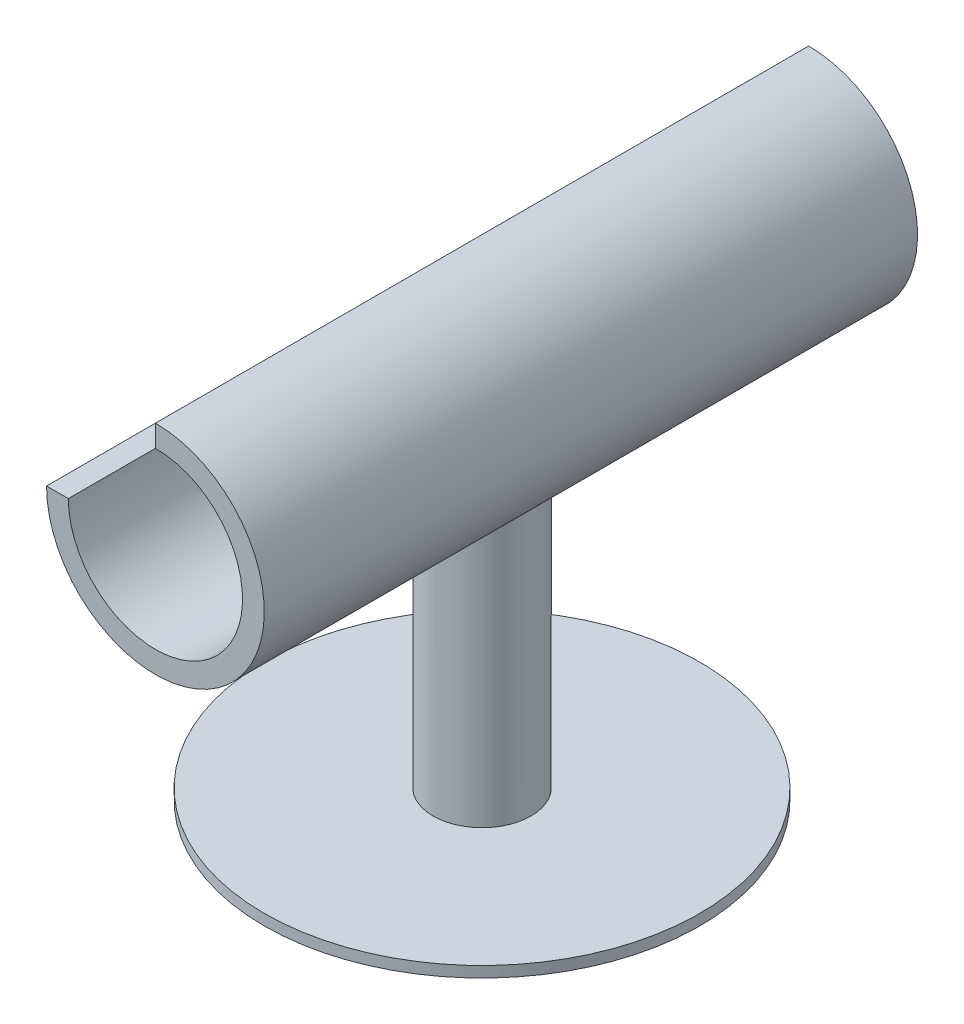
from build123d import *

# Parameters (mm, degrees)
ESQUISSE1_R             = 20
ESQUISSE1_R_2           = 16
BOSS_EXTRU_1_DEPTH      = 120
ESQUISSE2_R             = 40
BOSS_EXTRU_2_DEPTH      = 2
BOSS_EXTRU_3_REACH      = 156.091
BOSS_EXTRU_3_END_RADIUS = 20
ESQUISSE3_R             = 9
ESQUISSE4_W             = 36.825289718
ESQUISSE4_H             = 26.351848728
ENL_V_MAT_EXTRU_1_DEPTH = 145.568323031


with BuildPart() as part:
    # Esquisse1 → Boss.-Extru.1 (new body)
    with BuildSketch(Plane.XY):
        with Locations(Location((0, 0, 0), (0, 0, 180))):
            Circle(ESQUISSE1_R)
        with Locations(Location((0, 0, 0), (0, 0, 180))):
            Circle(ESQUISSE1_R_2, mode=Mode.SUBTRACT)
    extrude(amount=BOSS_EXTRU_1_DEPTH)



with BuildPart() as body_2:
    # Esquisse2 → Boss.-Extru.2 (new body)
    with BuildSketch(Plane(origin=(0, -70, 0), x_dir=(-1, 0, 0), z_dir=(0, 1, 0))):
        with Locations(Location((0, 60, 0), (0, 0, 90))):
            Circle(ESQUISSE2_R)
    extrude(amount=BOSS_EXTRU_2_DEPTH)


with BuildPart() as part_1:
    add(part.part)

    add(body_2.part)  # Boss.-Extru.3 merges body 2
    # Boss.-Extru.3: up to this cylinder (the profile starts outside it)
    boss_extru_3_end = Plane(origin=(0, 0, 60), z_dir=(0, 0, -1)) * Cylinder(BOSS_EXTRU_3_END_RADIUS, 353.182, mode=Mode.PRIVATE)
    # Esquisse3 → Boss.-Extru.3 (add, up to the surface)
    with BuildSketch(Plane(origin=(0, -68, 0), x_dir=(1, 0, 0), z_dir=(0, 1, 0)), mode=Mode.PRIVATE) as boss_extru_3_sk1:
        with Locations(Location((0, -60, 0), (0, 0, 90))):
            Circle(ESQUISSE3_R)
    boss_extru_3_tool1 = extrude(boss_extru_3_sk1.sketch, amount=BOSS_EXTRU_3_REACH, mode=Mode.PRIVATE) - boss_extru_3_end
    add(boss_extru_3_tool1.solids().sort_by_distance((0, -68, 60))[0])

    # Esquisse4 → Enl_v. mat.-Extru.1 (cut, through all)
    with BuildSketch(Plane.XY.offset(120)):
        with Locations((-18.412644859, 13.175924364)):
            Rectangle(ESQUISSE4_W, ESQUISSE4_H)
    extrude(amount=-ENL_V_MAT_EXTRU_1_DEPTH, mode=Mode.SUBTRACT)


solid = part_1.part
